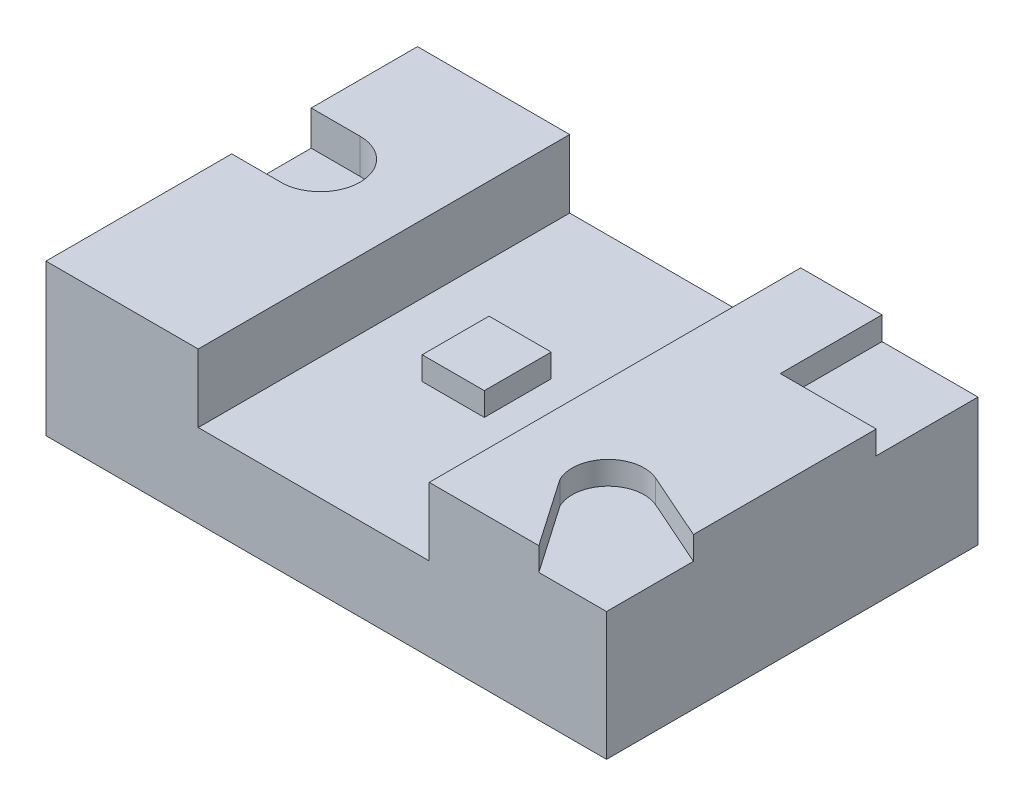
from build123d import *

# Parameters (mm, degrees)
EXTRUDE1_DEPTH     = 101.6
SKETCH2_W          = 26.247712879
SKETCH2_H          = 27.829585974
CUT_EXTRUDE1_DEPTH = 6.35
CUT_EXTRUDE2_DEPTH = 9.525
SKETCH4_W          = 17.000640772
SKETCH4_H          = 18.289101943
EXTRUDE2_DEPTH     = 6.35
CUT_EXTRUDE3_DEPTH = 6.35


with BuildPart() as part:
    # Sketch1 → Extrude1 (new body)
    with BuildSketch(Plane.XY):
        Polygon((-36.733440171, 47.018803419), (-78.364672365, 47.018803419), (-78.364672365, 5.6447363), (74.936217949, 5.6447363), (74.936217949, 47.018803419), (26.448076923, 47.018803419), (26.448076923, 28.407193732), (-36.733440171, 28.407193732), align=None)
    extrude(amount=EXTRUDE1_DEPTH)

    # Sketch2 → Cut-Extrude1 (cut)
    with BuildSketch(Plane(origin=(0, 47.018803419, 0), x_dir=(-1, 0, 0), z_dir=(0, 1, 0))):
        with Locations((-61.81236151, 13.914792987)):
            Rectangle(SKETCH2_W, SKETCH2_H)
    extrude(amount=-CUT_EXTRUDE1_DEPTH, mode=Mode.SUBTRACT)

    # Sketch3 → Cut-Extrude2 (cut)
    with BuildSketch(Plane(origin=(0, 47.018803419, 0), x_dir=(-1, 0, 0), z_dir=(0, 1, 0))):
        with BuildLine():
            Line((78.364672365, 29.068044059), (64.982468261, 29.068044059))
            ThreePointArc((64.982468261, 29.068044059), (54.105906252, 39.475020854), (64.023043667, 50.8))
            Line((64.023043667, 50.8), (78.364672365, 50.8))
            Line((78.364672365, 50.8), (78.364672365, 29.068044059))
        make_face()
    extrude(amount=-CUT_EXTRUDE2_DEPTH, mode=Mode.SUBTRACT)

    # Sketch4 → Extrude2 (add)
    with BuildSketch(Plane(origin=(0, 28.407193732, 0), x_dir=(-1, 0, 0), z_dir=(0, 1, 0))):
        with Locations((8.500320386, 50.936485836)):
            Rectangle(SKETCH4_W, SKETCH4_H)
    extrude(amount=EXTRUDE2_DEPTH)

    # Sketch5 → Cut-Extrude3 (cut)
    with BuildSketch(Plane(origin=(0, 47.018803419, 0), x_dir=(-1, 0, 0), z_dir=(0, 1, 0))):
        with BuildLine():
            Line((-74.936217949, 77.824195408), (-56.428738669, 69.635045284))
            ThreePointArc((-56.428738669, 69.635045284), (-45.325673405, 71.825976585), (-43.599070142, 83.010657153))
            Line((-43.599070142, 83.010657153), (-56.428738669, 101.6))
            Line((-56.428738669, 101.6), (-74.936217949, 101.6))
            Line((-74.936217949, 101.6), (-74.936217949, 77.824195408))
        make_face()
    extrude(amount=-CUT_EXTRUDE3_DEPTH, mode=Mode.SUBTRACT)


solid = part.part
